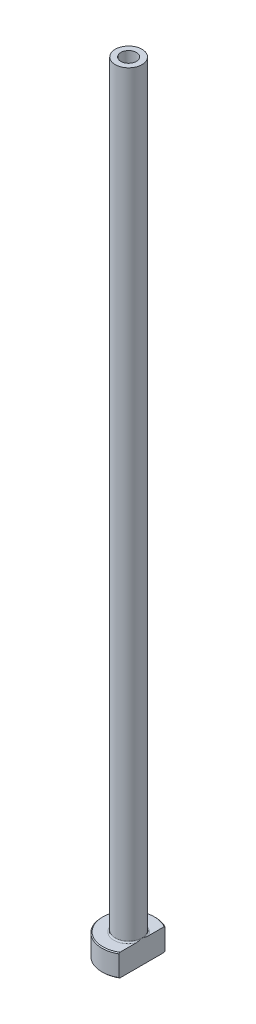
ISO-10303-21;
HEADER;
FILE_DESCRIPTION(('STEP AP214'),'2;1');
FILE_NAME('part.step','',(''),(''),'','','');
FILE_SCHEMA(('AUTOMOTIVE_DESIGN { 1 0 10303 214 1 1 1 1 }'));
ENDSEC;
DATA;
#1=APPLICATION_CONTEXT('core data for automotive mechanical design processes');
#2=APPLICATION_PROTOCOL_DEFINITION('international standard','automotive_design',2000,#1);
#3=PRODUCT_CONTEXT('',#1,'mechanical');
#4=PRODUCT('Part','Part','',(#3));
#5=PRODUCT_RELATED_PRODUCT_CATEGORY('part','',(#4));
#6=PRODUCT_DEFINITION_FORMATION('','',#4);
#7=PRODUCT_DEFINITION_CONTEXT('part definition',#1,'design');
#8=PRODUCT_DEFINITION('design','',#6,#7);
#9=PRODUCT_DEFINITION_SHAPE('','',#8);
#10=(LENGTH_UNIT() NAMED_UNIT(*) SI_UNIT(.MILLI.,.METRE.));
#11=(NAMED_UNIT(*) PLANE_ANGLE_UNIT() SI_UNIT($,.RADIAN.));
#12=(NAMED_UNIT(*) SI_UNIT($,.STERADIAN.) SOLID_ANGLE_UNIT());
#13=UNCERTAINTY_MEASURE_WITH_UNIT(LENGTH_MEASURE(1.E-05),#10,'distance_accuracy_value','');
#14=(GEOMETRIC_REPRESENTATION_CONTEXT(3) GLOBAL_UNCERTAINTY_ASSIGNED_CONTEXT((#13)) GLOBAL_UNIT_ASSIGNED_CONTEXT((#10,
#11,#12)) REPRESENTATION_CONTEXT('',''));
#15=CARTESIAN_POINT('',(0.,0.,0.));
#16=DIRECTION('',(0.,0.,1.));
#17=DIRECTION('',(1.,0.,0.));
#18=AXIS2_PLACEMENT_3D('',#15,#16,#17);
#19=CARTESIAN_POINT('',(0.,92.1876809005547,0.));
#20=DIRECTION('',(0.,1.,0.));
#21=DIRECTION('',(0.,0.,1.));
#22=AXIS2_PLACEMENT_3D('',#19,#20,#21);
#23=CYLINDRICAL_SURFACE('',#22,1.75);
#24=CARTESIAN_POINT('',(0.,175.,0.));
#25=DIRECTION('',(0.,1.,0.));
#26=DIRECTION('',(0.,0.,1.));
#27=AXIS2_PLACEMENT_3D('',#24,#25,#26);
#28=CIRCLE('',#27,1.75);
#29=CARTESIAN_POINT('',(0.,175.,1.75));
#30=VERTEX_POINT('',#29);
#31=EDGE_CURVE('E167',#30,#30,#28,.T.);
#32=ORIENTED_EDGE('',*,*,#31,.T.);
#33=EDGE_LOOP('',(#32));
#34=FACE_BOUND('',#33,.T.);
#35=CARTESIAN_POINT('',(0.,130.,0.));
#36=DIRECTION('',(0.,1.,0.));
#37=DIRECTION('',(0.,0.,1.));
#38=AXIS2_PLACEMENT_3D('',#35,#36,#37);
#39=CIRCLE('',#38,1.75);
#40=CARTESIAN_POINT('',(0.,130.,1.75));
#41=VERTEX_POINT('',#40);
#42=EDGE_CURVE('E170',#41,#41,#39,.T.);
#43=ORIENTED_EDGE('',*,*,#42,.F.);
#44=EDGE_LOOP('',(#43));
#45=FACE_BOUND('',#44,.T.);
#46=ADVANCED_FACE('F32',(#34,#45),#23,.F.);
#47=CARTESIAN_POINT('',(-1.75,175.,0.));
#48=DIRECTION('',(0.,1.,0.));
#49=DIRECTION('',(0.,0.,1.));
#50=AXIS2_PLACEMENT_3D('',#47,#48,#49);
#51=PLANE('',#50);
#52=CARTESIAN_POINT('',(0.,175.,0.));
#53=DIRECTION('',(0.,1.,0.));
#54=DIRECTION('',(0.,0.,1.));
#55=AXIS2_PLACEMENT_3D('',#52,#53,#54);
#56=CIRCLE('',#55,3.00000000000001);
#57=CARTESIAN_POINT('',(0.,175.,3.00000000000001));
#58=VERTEX_POINT('',#57);
#59=EDGE_CURVE('E174',#58,#58,#56,.T.);
#60=ORIENTED_EDGE('',*,*,#59,.T.);
#61=EDGE_LOOP('',(#60));
#62=FACE_BOUND('',#61,.T.);
#63=ORIENTED_EDGE('',*,*,#31,.F.);
#64=EDGE_LOOP('',(#63));
#65=FACE_BOUND('',#64,.T.);
#66=ADVANCED_FACE('F157',(#62,#65),#51,.T.);
#67=CARTESIAN_POINT('',(0.,92.1876809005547,0.));
#68=DIRECTION('',(0.,1.,0.));
#69=DIRECTION('',(0.,0.,1.));
#70=AXIS2_PLACEMENT_3D('',#67,#68,#69);
#71=CYLINDRICAL_SURFACE('',#70,3.);
#72=CARTESIAN_POINT('',(0.,5.3,0.));
#73=DIRECTION('',(0.,1.,0.));
#74=DIRECTION('',(0.,0.,1.));
#75=AXIS2_PLACEMENT_3D('',#72,#73,#74);
#76=CIRCLE('',#75,3.);
#77=CARTESIAN_POINT('',(3.,5.3,0.));
#78=VERTEX_POINT('',#77);
#79=EDGE_CURVE('E180',#78,#78,#76,.T.);
#80=ORIENTED_EDGE('',*,*,#79,.T.);
#81=EDGE_LOOP('',(#80));
#82=FACE_BOUND('',#81,.T.);
#83=ORIENTED_EDGE('',*,*,#59,.F.);
#84=EDGE_LOOP('',(#83));
#85=FACE_BOUND('',#84,.T.);
#86=ADVANCED_FACE('F162',(#82,#85),#71,.T.);
#87=CARTESIAN_POINT('',(-2.99999999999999,5.,0.));
#88=DIRECTION('',(0.,1.,0.));
#89=DIRECTION('',(0.,0.,1.));
#90=AXIS2_PLACEMENT_3D('',#87,#88,#89);
#91=PLANE('',#90);
#92=DIRECTION('',(0.,0.,1.));
#93=VECTOR('',#92,1.);
#94=CARTESIAN_POINT('',(3.,5.,0.));
#95=LINE('',#94,#93);
#96=CARTESIAN_POINT('',(3.,5.,-4.96386945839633));
#97=VERTEX_POINT('',#96);
#98=CARTESIAN_POINT('',(3.,5.,-1.37477270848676));
#99=VERTEX_POINT('',#98);
#100=EDGE_CURVE('E54',#97,#99,#95,.T.);
#101=ORIENTED_EDGE('',*,*,#100,.F.);
#102=CARTESIAN_POINT('',(0.,5.,0.));
#103=DIRECTION('',(0.,1.,0.));
#104=DIRECTION('',(0.,0.,1.));
#105=AXIS2_PLACEMENT_3D('',#102,#103,#104);
#106=CIRCLE('',#105,5.79999999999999);
#107=CARTESIAN_POINT('',(2.99999999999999,5.,4.96386945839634));
#108=VERTEX_POINT('',#107);
#109=EDGE_CURVE('E186',#97,#108,#106,.T.);
#110=ORIENTED_EDGE('',*,*,#109,.T.);
#111=CARTESIAN_POINT('',(3.,5.,1.37477270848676));
#112=VERTEX_POINT('',#111);
#113=EDGE_CURVE('E134',#112,#108,#95,.T.);
#114=ORIENTED_EDGE('',*,*,#113,.F.);
#115=CARTESIAN_POINT('',(0.,5.,0.));
#116=DIRECTION('',(0.,1.,0.));
#117=DIRECTION('',(0.,0.,1.));
#118=AXIS2_PLACEMENT_3D('',#115,#116,#117);
#119=CIRCLE('',#118,3.3);
#120=EDGE_CURVE('E183',#112,#99,#119,.F.);
#121=ORIENTED_EDGE('',*,*,#120,.T.);
#122=EDGE_LOOP('',(#101,#110,#114,#121));
#123=FACE_BOUND('',#122,.T.);
#124=ADVANCED_FACE('F197',(#123),#91,.T.);
#125=CARTESIAN_POINT('',(0.,92.1876809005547,0.));
#126=DIRECTION('',(0.,1.,0.));
#127=DIRECTION('',(0.,0.,1.));
#128=AXIS2_PLACEMENT_3D('',#125,#126,#127);
#129=CYLINDRICAL_SURFACE('',#128,5.99999999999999);
#130=DIRECTION('',(0.,-1.,0.));
#131=VECTOR('',#130,1.);
#132=CARTESIAN_POINT('',(2.99999999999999,175.,5.19615242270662));
#133=LINE('',#132,#131);
#134=CARTESIAN_POINT('',(2.99999999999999,4.8,5.19615242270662));
#135=VERTEX_POINT('',#134);
#136=CARTESIAN_POINT('',(2.99999999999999,0.20000000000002,5.19615242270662));
#137=VERTEX_POINT('',#136);
#138=EDGE_CURVE('E82',#135,#137,#133,.T.);
#139=ORIENTED_EDGE('',*,*,#138,.F.);
#140=CARTESIAN_POINT('',(0.,4.8,0.));
#141=DIRECTION('',(0.,1.,0.));
#142=DIRECTION('',(0.,0.,1.));
#143=AXIS2_PLACEMENT_3D('',#140,#141,#142);
#144=CIRCLE('',#143,5.99999999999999);
#145=CARTESIAN_POINT('',(3.,4.8,-5.19615242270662));
#146=VERTEX_POINT('',#145);
#147=EDGE_CURVE('E95',#135,#146,#144,.F.);
#148=ORIENTED_EDGE('',*,*,#147,.T.);
#149=DIRECTION('',(0.,-1.,0.));
#150=VECTOR('',#149,1.);
#151=CARTESIAN_POINT('',(3.,175.,-5.19615242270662));
#152=LINE('',#151,#150);
#153=CARTESIAN_POINT('',(3.,0.20000000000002,-5.19615242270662));
#154=VERTEX_POINT('',#153);
#155=EDGE_CURVE('E192',#146,#154,#152,.T.);
#156=ORIENTED_EDGE('',*,*,#155,.T.);
#157=CARTESIAN_POINT('',(0.,0.20000000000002,0.));
#158=DIRECTION('',(0.,-1.,0.));
#159=DIRECTION('',(0.,0.,-1.));
#160=AXIS2_PLACEMENT_3D('',#157,#158,#159);
#161=CIRCLE('',#160,5.99999999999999);
#162=EDGE_CURVE('E98',#154,#137,#161,.F.);
#163=ORIENTED_EDGE('',*,*,#162,.T.);
#164=EDGE_LOOP('',(#139,#148,#156,#163));
#165=FACE_BOUND('',#164,.T.);
#166=ADVANCED_FACE('F190',(#165),#129,.T.);
#167=CARTESIAN_POINT('',(-5.99999999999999,0.,0.));
#168=DIRECTION('',(0.,-1.,0.));
#169=DIRECTION('',(0.,0.,-1.));
#170=AXIS2_PLACEMENT_3D('',#167,#168,#169);
#171=PLANE('',#170);
#172=CARTESIAN_POINT('',(0.,0.,0.));
#173=DIRECTION('',(0.,-1.,0.));
#174=DIRECTION('',(0.,0.,-1.));
#175=AXIS2_PLACEMENT_3D('',#172,#173,#174);
#176=CIRCLE('',#175,2.49999999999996);
#177=CARTESIAN_POINT('',(0.,0.,-2.49999999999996));
#178=VERTEX_POINT('',#177);
#179=EDGE_CURVE('E40',#178,#178,#176,.F.);
#180=ORIENTED_EDGE('',*,*,#179,.T.);
#181=EDGE_LOOP('',(#180));
#182=FACE_BOUND('',#181,.T.);
#183=DIRECTION('',(0.,0.,-1.));
#184=VECTOR('',#183,1.);
#185=CARTESIAN_POINT('',(2.99999999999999,0.,5.19615242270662));
#186=LINE('',#185,#184);
#187=CARTESIAN_POINT('',(2.99999999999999,0.,4.96386945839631));
#188=VERTEX_POINT('',#187);
#189=CARTESIAN_POINT('',(2.99999999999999,0.,-4.96386945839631));
#190=VERTEX_POINT('',#189);
#191=EDGE_CURVE('E47',#188,#190,#186,.T.);
#192=ORIENTED_EDGE('',*,*,#191,.F.);
#193=CARTESIAN_POINT('',(0.,0.,0.));
#194=DIRECTION('',(0.,-1.,0.));
#195=DIRECTION('',(0.,0.,-1.));
#196=AXIS2_PLACEMENT_3D('',#193,#194,#195);
#197=CIRCLE('',#196,5.79999999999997);
#198=EDGE_CURVE('E92',#188,#190,#197,.T.);
#199=ORIENTED_EDGE('',*,*,#198,.T.);
#200=EDGE_LOOP('',(#192,#199));
#201=FACE_BOUND('',#200,.T.);
#202=ADVANCED_FACE('F91',(#182,#201),#171,.T.);
#203=CARTESIAN_POINT('',(0.,92.1876809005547,0.));
#204=DIRECTION('',(0.,1.,0.));
#205=DIRECTION('',(0.,0.,1.));
#206=AXIS2_PLACEMENT_3D('',#203,#204,#205);
#207=CYLINDRICAL_SURFACE('',#206,2.);
#208=CARTESIAN_POINT('',(0.,0.499999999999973,0.));
#209=DIRECTION('',(0.,-1.,0.));
#210=DIRECTION('',(0.,0.,-1.));
#211=AXIS2_PLACEMENT_3D('',#208,#209,#210);
#212=CIRCLE('',#211,2.);
#213=CARTESIAN_POINT('',(0.,0.499999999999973,-2.));
#214=VERTEX_POINT('',#213);
#215=EDGE_CURVE('E11',#214,#214,#212,.T.);
#216=ORIENTED_EDGE('',*,*,#215,.T.);
#217=EDGE_LOOP('',(#216));
#218=FACE_BOUND('',#217,.T.);
#219=CARTESIAN_POINT('',(0.,118.,0.));
#220=DIRECTION('',(0.,1.,0.));
#221=DIRECTION('',(0.,0.,1.));
#222=AXIS2_PLACEMENT_3D('',#219,#220,#221);
#223=CIRCLE('',#222,2.);
#224=CARTESIAN_POINT('',(0.,118.,2.));
#225=VERTEX_POINT('',#224);
#226=EDGE_CURVE('E172',#225,#225,#223,.T.);
#227=ORIENTED_EDGE('',*,*,#226,.T.);
#228=EDGE_LOOP('',(#227));
#229=FACE_BOUND('',#228,.T.);
#230=ADVANCED_FACE('F215',(#218,#229),#207,.F.);
#231=CARTESIAN_POINT('',(0.,118.,0.));
#232=DIRECTION('',(0.,-1.,0.));
#233=DIRECTION('',(0.,0.,-1.));
#234=AXIS2_PLACEMENT_3D('',#231,#232,#233);
#235=CONICAL_SURFACE('',#234,2.,0.0208303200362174);
#236=ORIENTED_EDGE('',*,*,#42,.T.);
#237=EDGE_LOOP('',(#236));
#238=FACE_BOUND('',#237,.T.);
#239=ORIENTED_EDGE('',*,*,#226,.F.);
#240=EDGE_LOOP('',(#239));
#241=FACE_BOUND('',#240,.T.);
#242=ADVANCED_FACE('F111',(#238,#241),#235,.F.);
#243=CARTESIAN_POINT('',(0.,5.3,0.));
#244=DIRECTION('',(0.,1.,0.));
#245=DIRECTION('',(0.,0.,1.));
#246=AXIS2_PLACEMENT_3D('',#243,#244,#245);
#247=TOROIDAL_SURFACE('',#246,3.3,0.3);
#248=ORIENTED_EDGE('',*,*,#120,.F.);
#249=CARTESIAN_POINT('',(3.,5.3,0.));
#250=CARTESIAN_POINT('',(3.,5.30000062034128,-1.12611973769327E-10));
#251=CARTESIAN_POINT('',(3.,5.30000124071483,1.79706824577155E-07));
#252=CARTESIAN_POINT('',(3.,5.30000241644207,7.12597590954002E-07));
#253=CARTESIAN_POINT('',(3.,5.30000296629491,1.07470913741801E-06));
#254=CARTESIAN_POINT('',(3.,5.30000408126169,1.93940830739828E-06));
#255=CARTESIAN_POINT('',(3.,5.30000463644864,2.45488622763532E-06));
#256=CARTESIAN_POINT('',(3.,5.30000565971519,3.54465557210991E-06));
#257=CARTESIAN_POINT('',(3.,5.30000612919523,4.11770701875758E-06));
#258=CARTESIAN_POINT('',(3.,5.30000778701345,6.25396492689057E-06));
#259=CARTESIAN_POINT('',(3.,5.30000888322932,7.89070903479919E-06));
#260=CARTESIAN_POINT('',(3.,5.30001076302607,1.1199805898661E-05));
#261=CARTESIAN_POINT('',(3.,5.30001156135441,1.28642117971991E-05));
#262=CARTESIAN_POINT('',(3.,5.30001474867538,1.96537181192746E-05));
#263=CARTESIAN_POINT('',(3.,5.30001702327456,2.48380251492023E-05));
#264=CARTESIAN_POINT('',(3.,5.30002052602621,3.48178497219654E-05));
#265=CARTESIAN_POINT('',(3.,5.30002184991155,3.95800639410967E-05));
#266=CARTESIAN_POINT('',(2.99999999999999,5.30003122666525,7.41814399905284E-05));
#267=CARTESIAN_POINT('',(2.99999999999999,5.30003808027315,0.000104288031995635));
#268=CARTESIAN_POINT('',(3.,5.30006804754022,0.000222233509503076));
#269=CARTESIAN_POINT('',(2.99999999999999,5.3000968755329,0.00030855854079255));
#270=CARTESIAN_POINT('',(2.99999999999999,5.30020809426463,0.000648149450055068));
#271=CARTESIAN_POINT('',(2.99999999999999,5.30028657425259,0.00090233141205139));
#272=CARTESIAN_POINT('',(3.,5.30059876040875,0.00190491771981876));
#273=CARTESIAN_POINT('',(2.99999999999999,5.3008372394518,0.00265218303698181));
#274=CARTESIAN_POINT('',(2.99999999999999,5.30182192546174,0.00574694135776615));
#275=CARTESIAN_POINT('',(2.99999999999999,5.30256224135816,0.00809584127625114));
#276=CARTESIAN_POINT('',(3.,5.31160267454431,0.0367678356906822));
#277=CARTESIAN_POINT('',(3.,5.3199381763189,0.0630827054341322));
#278=CARTESIAN_POINT('',(2.99999999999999,5.33621504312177,0.114704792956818));
#279=CARTESIAN_POINT('',(2.99999999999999,5.34415908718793,0.140011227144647));
#280=CARTESIAN_POINT('',(3.,5.36094382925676,0.193774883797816));
#281=CARTESIAN_POINT('',(2.99999999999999,5.36977415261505,0.222235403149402));
#282=CARTESIAN_POINT('',(2.99999999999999,5.3873647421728,0.279512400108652));
#283=CARTESIAN_POINT('',(2.99999999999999,5.3961232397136,0.308329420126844));
#284=CARTESIAN_POINT('',(2.99999999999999,5.41726575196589,0.378880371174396));
#285=CARTESIAN_POINT('',(2.99999999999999,5.42952723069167,0.420651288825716));
#286=CARTESIAN_POINT('',(2.99999999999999,5.45309597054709,0.503357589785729));
#287=CARTESIAN_POINT('',(2.99999999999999,5.46441924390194,0.544288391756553));
#288=CARTESIAN_POINT('',(2.99999999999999,5.48778169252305,0.632156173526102));
#289=CARTESIAN_POINT('',(2.99999999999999,5.49969678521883,0.679126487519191));
#290=CARTESIAN_POINT('',(2.99999999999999,5.52221484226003,0.773740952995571));
#291=CARTESIAN_POINT('',(2.99999999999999,5.53280772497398,0.821387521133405));
#292=CARTESIAN_POINT('',(2.99999999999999,5.55291503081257,0.920589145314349));
#293=CARTESIAN_POINT('',(2.99999999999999,5.56229188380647,0.972172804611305));
#294=CARTESIAN_POINT('',(2.99999999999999,5.57838694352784,1.0757483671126));
#295=CARTESIAN_POINT('',(2.99999999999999,5.58510535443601,1.12774023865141));
#296=CARTESIAN_POINT('',(2.99999999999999,5.59681427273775,1.2492441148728));
#297=CARTESIAN_POINT('',(2.99999999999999,5.60051317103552,1.3189036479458));
#298=CARTESIAN_POINT('',(2.99999999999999,5.59966579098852,1.42270835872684));
#299=CARTESIAN_POINT('',(2.99999999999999,5.59835823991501,1.45688093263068));
#300=CARTESIAN_POINT('',(2.99999999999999,5.59322745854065,1.52502533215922));
#301=CARTESIAN_POINT('',(2.99999999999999,5.58940645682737,1.55899730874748));
#302=CARTESIAN_POINT('',(2.99999999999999,5.57976146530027,1.61947815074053));
#303=CARTESIAN_POINT('',(2.99999999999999,5.57451506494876,1.64607760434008));
#304=CARTESIAN_POINT('',(2.99999999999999,5.56161153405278,1.69883648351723));
#305=CARTESIAN_POINT('',(2.99999999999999,5.55394338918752,1.72499331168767));
#306=CARTESIAN_POINT('',(2.99999999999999,5.53555176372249,1.77650913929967));
#307=CARTESIAN_POINT('',(2.99999999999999,5.52480031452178,1.80185836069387));
#308=CARTESIAN_POINT('',(2.99999999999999,5.49948027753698,1.8505454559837));
#309=CARTESIAN_POINT('',(2.99999999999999,5.48493141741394,1.87389291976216));
#310=CARTESIAN_POINT('',(2.99999999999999,5.45992470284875,1.90552135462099));
#311=CARTESIAN_POINT('',(2.99999999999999,5.45133318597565,1.91527363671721));
#312=CARTESIAN_POINT('',(2.99999999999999,5.43294163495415,1.93360072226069));
#313=CARTESIAN_POINT('',(2.99999999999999,5.42314083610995,1.94217477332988));
#314=CARTESIAN_POINT('',(2.99999999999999,5.40215892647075,1.95778354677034));
#315=CARTESIAN_POINT('',(2.99999999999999,5.39096156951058,1.96479687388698));
#316=CARTESIAN_POINT('',(2.99999999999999,5.36742144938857,1.97652218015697));
#317=CARTESIAN_POINT('',(2.99999999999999,5.35508207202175,1.98124071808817));
#318=CARTESIAN_POINT('',(2.99999999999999,5.33320117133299,1.98690185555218));
#319=CARTESIAN_POINT('',(2.99999999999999,5.32383559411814,1.98852953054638));
#320=CARTESIAN_POINT('',(2.99999999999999,5.30496375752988,1.99016898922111));
#321=CARTESIAN_POINT('',(2.99999999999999,5.29545756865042,1.9901815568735));
#322=CARTESIAN_POINT('',(2.99999999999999,5.27659318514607,1.98858978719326));
#323=CARTESIAN_POINT('',(2.99999999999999,5.26723486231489,1.98698693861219));
#324=CARTESIAN_POINT('',(2.99999999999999,5.24889957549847,1.98229727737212));
#325=CARTESIAN_POINT('',(2.99999999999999,5.23992286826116,1.97920948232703));
#326=CARTESIAN_POINT('',(2.99999999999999,5.21981293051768,1.97059641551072));
#327=CARTESIAN_POINT('',(2.99999999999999,5.20887713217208,1.9646117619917));
#328=CARTESIAN_POINT('',(2.99999999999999,5.18811536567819,1.95095727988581));
#329=CARTESIAN_POINT('',(2.99999999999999,5.17829177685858,1.94328393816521));
#330=CARTESIAN_POINT('',(2.99999999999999,5.15512177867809,1.922542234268));
#331=CARTESIAN_POINT('',(2.99999999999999,5.14247568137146,1.90869680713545));
#332=CARTESIAN_POINT('',(2.99999999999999,5.11944595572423,1.87927587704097));
#333=CARTESIAN_POINT('',(2.99999999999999,5.10906527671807,1.86369815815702));
#334=CARTESIAN_POINT('',(2.99999999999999,5.08309609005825,1.81927355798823));
#335=CARTESIAN_POINT('',(2.99999999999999,5.0694854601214,1.78928084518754));
#336=CARTESIAN_POINT('',(2.99999999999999,5.04658664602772,1.7275196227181));
#337=CARTESIAN_POINT('',(2.99999999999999,5.03733582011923,1.69573828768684));
#338=CARTESIAN_POINT('',(2.99999999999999,5.02214318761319,1.63079918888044));
#339=CARTESIAN_POINT('',(2.99999999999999,5.01626537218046,1.59762686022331));
#340=CARTESIAN_POINT('',(2.99999999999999,5.00734002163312,1.53086029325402));
#341=CARTESIAN_POINT('',(2.99999999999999,5.0042979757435,1.49726536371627));
#342=CARTESIAN_POINT('',(2.99999999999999,5.00059037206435,1.43100872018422));
#343=CARTESIAN_POINT('',(2.99999999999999,4.99985343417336,1.39835069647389));
#344=CARTESIAN_POINT('',(2.99999999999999,5.000193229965,1.33318312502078));
#345=CARTESIAN_POINT('',(2.99999999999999,5.00126261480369,1.30067351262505));
#346=CARTESIAN_POINT('',(2.99999999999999,5.00569854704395,1.22190465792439));
#347=CARTESIAN_POINT('',(2.99999999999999,5.00984986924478,1.17569031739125));
#348=CARTESIAN_POINT('',(2.99999999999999,5.0206087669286,1.0835706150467));
#349=CARTESIAN_POINT('',(2.99999999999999,5.0272158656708,1.03766519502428));
#350=CARTESIAN_POINT('',(2.99999999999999,5.04258096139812,0.945130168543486));
#351=CARTESIAN_POINT('',(2.99999999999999,5.0513851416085,0.898508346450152));
#352=CARTESIAN_POINT('',(2.99999999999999,5.07066869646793,0.805496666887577));
#353=CARTESIAN_POINT('',(2.99999999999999,5.08115218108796,0.759107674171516));
#354=CARTESIAN_POINT('',(2.99999999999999,5.10738921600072,0.650207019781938));
#355=CARTESIAN_POINT('',(2.99999999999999,5.12369110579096,0.587828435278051));
#356=CARTESIAN_POINT('',(2.99999999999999,5.15777680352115,0.464212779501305));
#357=CARTESIAN_POINT('',(2.99999999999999,5.17554263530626,0.402970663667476));
#358=CARTESIAN_POINT('',(2.99999999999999,5.21006724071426,0.28759690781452));
#359=CARTESIAN_POINT('',(3.,5.22671796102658,0.233432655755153));
#360=CARTESIAN_POINT('',(2.99999999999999,5.25241226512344,0.150940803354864));
#361=CARTESIAN_POINT('',(2.99999999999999,5.26131063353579,0.122567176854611));
#362=CARTESIAN_POINT('',(3.,5.27905176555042,0.0662804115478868));
#363=CARTESIAN_POINT('',(3.,5.28789327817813,0.038366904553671));
#364=CARTESIAN_POINT('',(2.99999999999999,5.29743877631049,0.00809257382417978));
#365=CARTESIAN_POINT('',(2.99999999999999,5.29818012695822,0.00574041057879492));
#366=CARTESIAN_POINT('',(2.99999999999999,5.29916506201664,0.0026448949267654));
#367=CARTESIAN_POINT('',(3.,5.29940274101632,0.00190013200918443));
#368=CARTESIAN_POINT('',(2.99999999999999,5.29971394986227,0.000900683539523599));
#369=CARTESIAN_POINT('',(2.99999999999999,5.29979223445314,0.000647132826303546));
#370=CARTESIAN_POINT('',(2.99999999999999,5.29990321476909,0.000308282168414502));
#371=CARTESIAN_POINT('',(3.,5.29993200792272,0.00022206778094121));
#372=CARTESIAN_POINT('',(2.99999999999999,5.29996194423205,0.000104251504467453));
#373=CARTESIAN_POINT('',(2.99999999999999,5.29996879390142,7.41614237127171E-05));
#374=CARTESIAN_POINT('',(3.,5.29997816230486,3.9576670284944E-05));
#375=CARTESIAN_POINT('',(3.,5.29997948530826,3.48154662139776E-05));
#376=CARTESIAN_POINT('',(3.,5.29998298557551,2.48376276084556E-05));
#377=CARTESIAN_POINT('',(3.,5.29998525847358,1.96542450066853E-05));
#378=CARTESIAN_POINT('',(3.,5.29998844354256,1.28656652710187E-05));
#379=CARTESIAN_POINT('',(3.,5.29998924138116,1.12013347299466E-05));
#380=CARTESIAN_POINT('',(3.,5.29999112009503,7.89230008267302E-06));
#381=CARTESIAN_POINT('',(3.,5.29999221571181,6.25553517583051E-06));
#382=CARTESIAN_POINT('',(3.,5.29999387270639,4.11914356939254E-06));
#383=CARTESIAN_POINT('',(3.,5.29999434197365,3.54603083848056E-06));
#384=CARTESIAN_POINT('',(3.,5.29999536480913,2.45610059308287E-06));
#385=CARTESIAN_POINT('',(3.,5.29999591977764,1.94052220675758E-06));
#386=CARTESIAN_POINT('',(3.,5.2999970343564,1.07558317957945E-06));
#387=CARTESIAN_POINT('',(3.,5.29999758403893,7.13339401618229E-07));
#388=CARTESIAN_POINT('',(3.,5.29999875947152,1.80121922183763E-07));
#389=CARTESIAN_POINT('',(3.,5.29999937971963,1.12601418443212E-10));
#390=CARTESIAN_POINT('',(3.,5.3,0.));
#391=B_SPLINE_CURVE_WITH_KNOTS('',3,(#249,#250,#251,#252,#253,#254,#255,#256,#257,#258,#259,
#260,#261,#262,#263,#264,#265,#266,#267,#268,#269,#270,#271,#272,#273,#274,#275,#276,#277,#278,
#279,#280,#281,#282,#283,#284,#285,#286,#287,#288,#289,#290,#291,#292,#293,#294,#295,#296,#297,
#298,#299,#300,#301,#302,#303,#304,#305,#306,#307,#308,#309,#310,#311,#312,#313,#314,#315,#316,
#317,#318,#319,#320,#321,#322,#323,#324,#325,#326,#327,#328,#329,#330,#331,#332,#333,#334,#335,
#336,#337,#338,#339,#340,#341,#342,#343,#344,#345,#346,#347,#348,#349,#350,#351,#352,#353,#354,
#355,#356,#357,#358,#359,#360,#361,#362,#363,#364,#365,#366,#367,#368,#369,#370,#371,#372,#373,
#374,#375,#376,#377,#378,#379,#380,#381,#382,#383,#384,#385,#386,#387,#388,#389,#390),
.UNSPECIFIED.,.T.,.F.,(4,2,2,2,2,2,2,2,2,2,2,2,2,2,2,2,2,2,2,2,2,2,2,2,2,2,2,2,2,2,2,2,2,2,2,2,
2,2,2,2,2,2,2,2,2,2,2,2,2,2,2,2,2,2,2,2,2,2,2,2,2,2,2,2,2,2,2,2,2,2,4),(0.,1.86513864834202E-06,
3.83353246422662E-06,6.09513236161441E-06,8.31560540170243E-06,1.42000698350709E-05,
1.97335497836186E-05,3.66769861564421E-05,5.14858313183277E-05,0.000144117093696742,
0.00041677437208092,0.00121521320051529,0.00356794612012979,0.0109568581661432,
0.0937636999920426,0.173336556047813,0.262732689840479,0.353088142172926,0.483684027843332,
0.611082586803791,0.756439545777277,0.902844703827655,1.06007042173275,1.21728406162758,
1.4261166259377,1.52864191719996,1.63107642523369,1.71232857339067,1.79395571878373,
1.87634808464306,1.95832065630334,1.99722769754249,2.03615946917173,2.07559591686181,
2.11491897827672,2.14330913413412,2.1716855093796,2.20003575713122,2.22840478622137,
2.26559554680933,2.30286442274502,2.35880214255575,2.41481225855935,2.51307007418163,
2.61215518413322,2.71306273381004,2.81416520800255,2.91210427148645,3.00964583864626,
3.14875779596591,3.28784276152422,3.43014232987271,3.5727956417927,3.76617940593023,
3.95746724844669,4.12746077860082,4.21667041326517,4.30450746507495,4.31190664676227,
4.31425150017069,4.31504795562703,4.31532026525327,4.31541284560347,4.31542765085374,
4.31544458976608,4.31545012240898,4.31545600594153,4.315458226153,4.31546048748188,
4.31546245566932,4.31546432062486),.UNSPECIFIED.);
#392=EDGE_CURVE('E126',#112,#78,#391,.T.);
#393=ORIENTED_EDGE('',*,*,#392,.T.);
#394=ORIENTED_EDGE('',*,*,#79,.F.);
#395=CARTESIAN_POINT('',(3.,5.3,0.));
#396=CARTESIAN_POINT('',(3.,5.29999937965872,1.12612604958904E-10));
#397=CARTESIAN_POINT('',(3.,5.29999875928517,-1.79706824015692E-07));
#398=CARTESIAN_POINT('',(3.,5.29999758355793,-7.12597590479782E-07));
#399=CARTESIAN_POINT('',(3.,5.29999703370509,-1.07470913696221E-06));
#400=CARTESIAN_POINT('',(3.,5.29999591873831,-1.93940830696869E-06));
#401=CARTESIAN_POINT('',(3.,5.29999536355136,-2.45488622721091E-06));
#402=CARTESIAN_POINT('',(3.,5.29999434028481,-3.54465557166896E-06));
#403=CARTESIAN_POINT('',(3.,5.29999387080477,-4.1177070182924E-06));
#404=CARTESIAN_POINT('',(3.,5.29999221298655,-6.25396492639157E-06));
#405=CARTESIAN_POINT('',(3.,5.29999111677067,-7.89070903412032E-06));
#406=CARTESIAN_POINT('',(3.,5.29998923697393,-1.11998058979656E-05));
#407=CARTESIAN_POINT('',(3.,5.29998843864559,-1.28642117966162E-05));
#408=CARTESIAN_POINT('',(3.,5.29998525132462,-1.96537181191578E-05));
#409=CARTESIAN_POINT('',(3.,5.29998297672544,-2.48380251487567E-05));
#410=CARTESIAN_POINT('',(3.,5.29997947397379,-3.48178497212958E-05));
#411=CARTESIAN_POINT('',(3.,5.29997815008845,-3.95800639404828E-05));
#412=CARTESIAN_POINT('',(2.99999999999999,5.29996877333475,-7.41814399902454E-05));
#413=CARTESIAN_POINT('',(2.99999999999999,5.29996191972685,-0.000104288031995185));
#414=CARTESIAN_POINT('',(3.,5.29993195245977,-0.000222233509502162));
#415=CARTESIAN_POINT('',(2.99999999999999,5.2999031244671,-0.000308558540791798));
#416=CARTESIAN_POINT('',(2.99999999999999,5.29979190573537,-0.000648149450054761));
#417=CARTESIAN_POINT('',(2.99999999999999,5.2997134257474,-0.00090233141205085));
#418=CARTESIAN_POINT('',(3.,5.29940123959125,-0.00190491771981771));
#419=CARTESIAN_POINT('',(2.99999999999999,5.29916276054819,-0.00265218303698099));
#420=CARTESIAN_POINT('',(2.99999999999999,5.29817807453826,-0.00574694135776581));
#421=CARTESIAN_POINT('',(2.99999999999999,5.29743775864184,-0.00809584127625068));
#422=CARTESIAN_POINT('',(3.,5.28839732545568,-0.0367678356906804));
#423=CARTESIAN_POINT('',(3.,5.2800618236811,-0.0630827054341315));
#424=CARTESIAN_POINT('',(2.99999999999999,5.26378495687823,-0.114704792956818));
#425=CARTESIAN_POINT('',(2.99999999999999,5.25584091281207,-0.140011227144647));
#426=CARTESIAN_POINT('',(3.,5.23905617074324,-0.193774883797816));
#427=CARTESIAN_POINT('',(2.99999999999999,5.23022584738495,-0.222235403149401));
#428=CARTESIAN_POINT('',(2.99999999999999,5.2126352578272,-0.279512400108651));
#429=CARTESIAN_POINT('',(2.99999999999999,5.2038767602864,-0.308329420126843));
#430=CARTESIAN_POINT('',(2.99999999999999,5.18273424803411,-0.378880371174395));
#431=CARTESIAN_POINT('',(2.99999999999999,5.17047276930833,-0.420651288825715));
#432=CARTESIAN_POINT('',(2.99999999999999,5.14690402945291,-0.503357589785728));
#433=CARTESIAN_POINT('',(2.99999999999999,5.13558075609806,-0.544288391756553));
#434=CARTESIAN_POINT('',(2.99999999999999,5.11221830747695,-0.632156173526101));
#435=CARTESIAN_POINT('',(2.99999999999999,5.10030321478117,-0.67912648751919));
#436=CARTESIAN_POINT('',(2.99999999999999,5.07778515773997,-0.773740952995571));
#437=CARTESIAN_POINT('',(2.99999999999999,5.06719227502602,-0.821387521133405));
#438=CARTESIAN_POINT('',(2.99999999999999,5.04708496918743,-0.920589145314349));
#439=CARTESIAN_POINT('',(2.99999999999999,5.03770811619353,-0.972172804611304));
#440=CARTESIAN_POINT('',(2.99999999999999,5.02161305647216,-1.07574836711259));
#441=CARTESIAN_POINT('',(2.99999999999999,5.01489464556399,-1.12774023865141));
#442=CARTESIAN_POINT('',(2.99999999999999,5.00318572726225,-1.2492441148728));
#443=CARTESIAN_POINT('',(2.99999999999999,4.99948682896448,-1.3189036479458));
#444=CARTESIAN_POINT('',(2.99999999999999,5.00033420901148,-1.42270835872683));
#445=CARTESIAN_POINT('',(2.99999999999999,5.00164176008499,-1.45688093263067));
#446=CARTESIAN_POINT('',(2.99999999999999,5.00677254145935,-1.52502533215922));
#447=CARTESIAN_POINT('',(2.99999999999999,5.01059354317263,-1.55899730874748));
#448=CARTESIAN_POINT('',(2.99999999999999,5.02023853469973,-1.61947815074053));
#449=CARTESIAN_POINT('',(2.99999999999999,5.02548493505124,-1.64607760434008));
#450=CARTESIAN_POINT('',(2.99999999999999,5.03838846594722,-1.69883648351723));
#451=CARTESIAN_POINT('',(2.99999999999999,5.04605661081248,-1.72499331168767));
#452=CARTESIAN_POINT('',(2.99999999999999,5.06444823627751,-1.77650913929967));
#453=CARTESIAN_POINT('',(2.99999999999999,5.07519968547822,-1.80185836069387));
#454=CARTESIAN_POINT('',(2.99999999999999,5.10051972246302,-1.8505454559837));
#455=CARTESIAN_POINT('',(2.99999999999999,5.11506858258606,-1.87389291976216));
#456=CARTESIAN_POINT('',(2.99999999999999,5.14007529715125,-1.905521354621));
#457=CARTESIAN_POINT('',(2.99999999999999,5.14866681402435,-1.91527363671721));
#458=CARTESIAN_POINT('',(2.99999999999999,5.16705836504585,-1.9336007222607));
#459=CARTESIAN_POINT('',(2.99999999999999,5.17685916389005,-1.94217477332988));
#460=CARTESIAN_POINT('',(2.99999999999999,5.19784107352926,-1.95778354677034));
#461=CARTESIAN_POINT('',(2.99999999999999,5.20903843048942,-1.96479687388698));
#462=CARTESIAN_POINT('',(2.99999999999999,5.23257855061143,-1.97652218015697));
#463=CARTESIAN_POINT('',(2.99999999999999,5.24491792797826,-1.98124071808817));
#464=CARTESIAN_POINT('',(2.99999999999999,5.26679882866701,-1.98690185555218));
#465=CARTESIAN_POINT('',(2.99999999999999,5.27616440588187,-1.98852953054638));
#466=CARTESIAN_POINT('',(2.99999999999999,5.29503624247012,-1.99016898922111));
#467=CARTESIAN_POINT('',(2.99999999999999,5.30454243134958,-1.9901815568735));
#468=CARTESIAN_POINT('',(2.99999999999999,5.32340681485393,-1.98858978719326));
#469=CARTESIAN_POINT('',(2.99999999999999,5.33276513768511,-1.98698693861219));
#470=CARTESIAN_POINT('',(2.99999999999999,5.35110042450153,-1.98229727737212));
#471=CARTESIAN_POINT('',(2.99999999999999,5.36007713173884,-1.97920948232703));
#472=CARTESIAN_POINT('',(2.99999999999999,5.38018706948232,-1.97059641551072));
#473=CARTESIAN_POINT('',(2.99999999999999,5.39112286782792,-1.9646117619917));
#474=CARTESIAN_POINT('',(2.99999999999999,5.41188463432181,-1.9509572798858));
#475=CARTESIAN_POINT('',(2.99999999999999,5.42170822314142,-1.94328393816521));
#476=CARTESIAN_POINT('',(2.99999999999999,5.44487822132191,-1.92254223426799));
#477=CARTESIAN_POINT('',(2.99999999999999,5.45752431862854,-1.90869680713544));
#478=CARTESIAN_POINT('',(2.99999999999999,5.48055404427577,-1.87927587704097));
#479=CARTESIAN_POINT('',(2.99999999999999,5.49093472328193,-1.86369815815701));
#480=CARTESIAN_POINT('',(2.99999999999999,5.51690390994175,-1.81927355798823));
#481=CARTESIAN_POINT('',(2.99999999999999,5.5305145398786,-1.78928084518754));
#482=CARTESIAN_POINT('',(2.99999999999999,5.55341335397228,-1.7275196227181));
#483=CARTESIAN_POINT('',(2.99999999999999,5.56266417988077,-1.69573828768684));
#484=CARTESIAN_POINT('',(2.99999999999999,5.57785681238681,-1.63079918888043));
#485=CARTESIAN_POINT('',(2.99999999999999,5.58373462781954,-1.59762686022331));
#486=CARTESIAN_POINT('',(2.99999999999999,5.59265997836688,-1.53086029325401));
#487=CARTESIAN_POINT('',(2.99999999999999,5.5957020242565,-1.49726536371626));
#488=CARTESIAN_POINT('',(2.99999999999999,5.59940962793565,-1.43100872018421));
#489=CARTESIAN_POINT('',(2.99999999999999,5.60014656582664,-1.39835069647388));
#490=CARTESIAN_POINT('',(2.99999999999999,5.59980677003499,-1.33318312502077));
#491=CARTESIAN_POINT('',(2.99999999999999,5.59873738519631,-1.30067351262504));
#492=CARTESIAN_POINT('',(2.99999999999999,5.59430145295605,-1.22190465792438));
#493=CARTESIAN_POINT('',(2.99999999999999,5.59015013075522,-1.17569031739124));
#494=CARTESIAN_POINT('',(2.99999999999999,5.5793912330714,-1.08357061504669));
#495=CARTESIAN_POINT('',(2.99999999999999,5.57278413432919,-1.03766519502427));
#496=CARTESIAN_POINT('',(2.99999999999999,5.55741903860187,-0.945130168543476));
#497=CARTESIAN_POINT('',(2.99999999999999,5.54861485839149,-0.898508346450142));
#498=CARTESIAN_POINT('',(2.99999999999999,5.52933130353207,-0.805496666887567));
#499=CARTESIAN_POINT('',(2.99999999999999,5.51884781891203,-0.759107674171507));
#500=CARTESIAN_POINT('',(2.99999999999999,5.49261078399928,-0.650207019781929));
#501=CARTESIAN_POINT('',(2.99999999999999,5.47630889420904,-0.587828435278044));
#502=CARTESIAN_POINT('',(2.99999999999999,5.44222319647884,-0.4642127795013));
#503=CARTESIAN_POINT('',(2.99999999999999,5.42445736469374,-0.402970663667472));
#504=CARTESIAN_POINT('',(2.99999999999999,5.38993275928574,-0.287596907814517));
#505=CARTESIAN_POINT('',(3.,5.37328203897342,-0.23343265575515));
#506=CARTESIAN_POINT('',(2.99999999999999,5.34758773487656,-0.150940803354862));
#507=CARTESIAN_POINT('',(2.99999999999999,5.33868936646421,-0.122567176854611));
#508=CARTESIAN_POINT('',(3.,5.32094823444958,-0.0662804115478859));
#509=CARTESIAN_POINT('',(3.,5.31210672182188,-0.0383669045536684));
#510=CARTESIAN_POINT('',(2.99999999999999,5.3025612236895,-0.0080925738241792));
#511=CARTESIAN_POINT('',(2.99999999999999,5.30181987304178,-0.00574041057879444));
#512=CARTESIAN_POINT('',(2.99999999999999,5.30083493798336,-0.00264489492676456));
#513=CARTESIAN_POINT('',(3.,5.30059725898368,-0.00190013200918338));
#514=CARTESIAN_POINT('',(2.99999999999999,5.30028605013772,-0.000900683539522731));
#515=CARTESIAN_POINT('',(2.99999999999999,5.30020776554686,-0.000647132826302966));
#516=CARTESIAN_POINT('',(2.99999999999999,5.30009678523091,-0.000308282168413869));
#517=CARTESIAN_POINT('',(3.,5.30006799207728,-0.000222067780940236));
#518=CARTESIAN_POINT('',(2.99999999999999,5.30003805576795,-0.000104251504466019));
#519=CARTESIAN_POINT('',(2.99999999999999,5.30003120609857,-7.41614237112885E-05));
#520=CARTESIAN_POINT('',(3.,5.30002183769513,-3.95766702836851E-05));
#521=CARTESIAN_POINT('',(3.,5.30002051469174,-3.48154662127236E-05));
#522=CARTESIAN_POINT('',(3.,5.30001701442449,-2.48376276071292E-05));
#523=CARTESIAN_POINT('',(3.,5.30001474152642,-1.96542450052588E-05));
#524=CARTESIAN_POINT('',(3.,5.30001155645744,-1.28656652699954E-05));
#525=CARTESIAN_POINT('',(3.,5.30001075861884,-1.12013347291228E-05));
#526=CARTESIAN_POINT('',(3.,5.30000887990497,-7.8923000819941E-06));
#527=CARTESIAN_POINT('',(3.,5.30000778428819,-6.25553517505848E-06));
#528=CARTESIAN_POINT('',(3.,5.3000061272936,-4.11914356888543E-06));
#529=CARTESIAN_POINT('',(3.,5.30000565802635,-3.54603083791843E-06));
#530=CARTESIAN_POINT('',(3.,5.30000463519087,-2.4561005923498E-06));
#531=CARTESIAN_POINT('',(3.,5.30000408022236,-1.94052220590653E-06));
#532=CARTESIAN_POINT('',(3.,5.3000029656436,-1.07558317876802E-06));
#533=CARTESIAN_POINT('',(3.,5.30000241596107,-7.13339400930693E-07));
#534=CARTESIAN_POINT('',(3.,5.30000124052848,-1.80121921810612E-07));
#535=CARTESIAN_POINT('',(3.,5.30000062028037,-1.12601047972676E-10));
#536=CARTESIAN_POINT('',(3.,5.3,0.));
#537=B_SPLINE_CURVE_WITH_KNOTS('',3,(#395,#396,#397,#398,#399,#400,#401,#402,#403,#404,#405,
#406,#407,#408,#409,#410,#411,#412,#413,#414,#415,#416,#417,#418,#419,#420,#421,#422,#423,#424,
#425,#426,#427,#428,#429,#430,#431,#432,#433,#434,#435,#436,#437,#438,#439,#440,#441,#442,#443,
#444,#445,#446,#447,#448,#449,#450,#451,#452,#453,#454,#455,#456,#457,#458,#459,#460,#461,#462,
#463,#464,#465,#466,#467,#468,#469,#470,#471,#472,#473,#474,#475,#476,#477,#478,#479,#480,#481,
#482,#483,#484,#485,#486,#487,#488,#489,#490,#491,#492,#493,#494,#495,#496,#497,#498,#499,#500,
#501,#502,#503,#504,#505,#506,#507,#508,#509,#510,#511,#512,#513,#514,#515,#516,#517,#518,#519,
#520,#521,#522,#523,#524,#525,#526,#527,#528,#529,#530,#531,#532,#533,#534,#535,#536),
.UNSPECIFIED.,.T.,.F.,(4,2,2,2,2,2,2,2,2,2,2,2,2,2,2,2,2,2,2,2,2,2,2,2,2,2,2,2,2,2,2,2,2,2,2,2,
2,2,2,2,2,2,2,2,2,2,2,2,2,2,2,2,2,2,2,2,2,2,2,2,2,2,2,2,2,2,2,2,2,2,4),(0.,1.86513864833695E-06,
3.83353246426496E-06,6.09513236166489E-06,8.31560540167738E-06,1.42000698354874E-05,
1.97335497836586E-05,3.66769861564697E-05,5.14858313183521E-05,0.000144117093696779,
0.000416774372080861,0.00121521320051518,0.00356794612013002,0.0109568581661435,
0.0937636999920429,0.173336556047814,0.262732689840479,0.353088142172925,0.483684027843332,
0.611082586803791,0.756439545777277,0.902844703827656,1.06007042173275,1.21728406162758,
1.42611662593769,1.52864191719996,1.63107642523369,1.71232857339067,1.79395571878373,
1.87634808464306,1.95832065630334,1.99722769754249,2.03615946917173,2.07559591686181,
2.11491897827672,2.14330913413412,2.1716855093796,2.20003575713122,2.22840478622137,
2.26559554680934,2.30286442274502,2.35880214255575,2.41481225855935,2.51307007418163,
2.61215518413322,2.71306273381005,2.81416520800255,2.91210427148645,3.00964583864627,
3.14875779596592,3.28784276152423,3.43014232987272,3.57279564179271,3.76617940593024,
3.95746724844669,4.12746077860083,4.21667041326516,4.30450746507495,4.31190664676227,
4.31425150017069,4.31504795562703,4.31532026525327,4.31541284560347,4.31542765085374,
4.31544458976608,4.31545012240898,4.31545600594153,4.315458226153,4.31546048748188,
4.31546245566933,4.31546432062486),.UNSPECIFIED.);
#538=EDGE_CURVE('E135',#78,#99,#537,.T.);
#539=ORIENTED_EDGE('',*,*,#538,.T.);
#540=EDGE_LOOP('',(#248,#393,#394,#539));
#541=FACE_BOUND('',#540,.T.);
#542=ADVANCED_FACE('F141',(#541),#247,.F.);
#543=CARTESIAN_POINT('',(0.,5.,0.));
#544=DIRECTION('',(0.,-1.,0.));
#545=DIRECTION('',(0.,0.,-1.));
#546=AXIS2_PLACEMENT_3D('',#543,#544,#545);
#547=CONICAL_SURFACE('',#546,5.79999999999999,0.785398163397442);
#548=CARTESIAN_POINT('',(3.,-1.01993959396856,-11.432889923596));
#549=CARTESIAN_POINT('',(3.,-0.769424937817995,-11.1738796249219));
#550=CARTESIAN_POINT('',(3.,-0.519179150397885,-10.9146084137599));
#551=CARTESIAN_POINT('',(3.,-0.0193842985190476,-10.395389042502));
#552=CARTESIAN_POINT('',(3.,0.230164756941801,-10.1354408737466));
#553=CARTESIAN_POINT('',(3.,0.728528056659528,-9.61458602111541));
#554=CARTESIAN_POINT('',(3.,0.97734186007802,-9.3536789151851));
#555=CARTESIAN_POINT('',(3.,1.47386965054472,-8.8308227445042));
#556=CARTESIAN_POINT('',(3.,1.72158364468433,-8.56887368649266));
#557=CARTESIAN_POINT('',(3.,2.21069282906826,-8.04884148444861));
#558=CARTESIAN_POINT('',(3.,2.45211594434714,-7.79078462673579));
#559=CARTESIAN_POINT('',(3.,2.93315589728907,-7.2729934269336));
#560=CARTESIAN_POINT('',(3.,3.17277274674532,-7.01325909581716));
#561=CARTESIAN_POINT('',(3.,3.64950020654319,-6.49159990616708));
#562=CARTESIAN_POINT('',(3.,3.88661134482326,-6.2296755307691));
#563=CARTESIAN_POINT('',(3.,4.35738571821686,-5.70275148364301));
#564=CARTESIAN_POINT('',(3.,4.59104909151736,-5.43775193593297));
#565=CARTESIAN_POINT('',(3.,4.96416348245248,-5.00636825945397));
#566=CARTESIAN_POINT('',(3.,5.10520133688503,-4.84135845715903));
#567=CARTESIAN_POINT('',(3.,5.38476673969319,-4.50919282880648));
#568=CARTESIAN_POINT('',(3.,5.52329404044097,-4.34203679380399));
#569=CARTESIAN_POINT('',(3.,5.79842961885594,-4.00319933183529));
#570=CARTESIAN_POINT('',(3.,5.93500216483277,-3.83148875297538));
#571=CARTESIAN_POINT('',(3.,6.20336281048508,-3.48442112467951));
#572=CARTESIAN_POINT('',(3.,6.33515205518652,-3.30906496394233));
#573=CARTESIAN_POINT('',(3.,6.59393382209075,-2.95070802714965));
#574=CARTESIAN_POINT('',(2.99999999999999,6.72082315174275,-2.76763161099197));
#575=CARTESIAN_POINT('',(2.99999999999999,6.90336321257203,-2.48771743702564));
#576=CARTESIAN_POINT('',(2.99999999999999,6.96295431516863,-2.39345390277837));
#577=CARTESIAN_POINT('',(2.99999999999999,7.07882720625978,-2.20292146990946));
#578=CARTESIAN_POINT('',(2.99999999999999,7.13510937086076,-2.10665280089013));
#579=CARTESIAN_POINT('',(2.99999999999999,7.24288059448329,-1.91297779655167));
#580=CARTESIAN_POINT('',(2.99999999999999,7.29441986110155,-1.81559978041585));
#581=CARTESIAN_POINT('',(2.99999999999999,7.39241237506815,-1.61833215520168));
#582=CARTESIAN_POINT('',(2.99999999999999,7.43886469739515,-1.51844209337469));
#583=CARTESIAN_POINT('',(2.99999999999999,7.56840030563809,-1.21511948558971));
#584=CARTESIAN_POINT('',(2.99999999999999,7.64209011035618,-1.00730397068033));
#585=CARTESIAN_POINT('',(2.99999999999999,7.72186700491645,-0.695731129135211));
#586=CARTESIAN_POINT('',(2.99999999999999,7.7430290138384,-0.59579170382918));
#587=CARTESIAN_POINT('',(2.99999999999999,7.77582528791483,-0.394325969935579));
#588=CARTESIAN_POINT('',(2.99999999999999,7.78746040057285,-0.292799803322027));
#589=CARTESIAN_POINT('',(2.99999999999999,7.80037895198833,-0.0893987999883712));
#590=CARTESIAN_POINT('',(2.99999999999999,7.80169449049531,0.0124739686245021));
#591=CARTESIAN_POINT('',(2.99999999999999,7.79396363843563,0.215826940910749));
#592=CARTESIAN_POINT('',(2.99999999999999,7.78491639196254,0.317307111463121));
#593=CARTESIAN_POINT('',(2.99999999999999,7.75721241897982,0.518039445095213));
#594=CARTESIAN_POINT('',(2.99999999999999,7.73863812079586,0.617303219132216));
#595=CARTESIAN_POINT('',(2.99999999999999,7.69303955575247,0.813850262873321));
#596=CARTESIAN_POINT('',(2.99999999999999,7.66601427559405,0.911133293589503));
#597=CARTESIAN_POINT('',(2.99999999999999,7.60464499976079,1.10394843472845));
#598=CARTESIAN_POINT('',(2.99999999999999,7.57025976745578,1.19946724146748));
#599=CARTESIAN_POINT('',(2.99999999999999,7.4955576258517,1.38810736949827));
#600=CARTESIAN_POINT('',(2.99999999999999,7.45524192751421,1.48122917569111));
#601=CARTESIAN_POINT('',(2.99999999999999,7.36961028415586,1.66561491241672));
#602=CARTESIAN_POINT('',(2.99999999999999,7.32427350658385,1.75686908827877));
#603=CARTESIAN_POINT('',(2.99999999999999,7.22966073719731,1.93732130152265));
#604=CARTESIAN_POINT('',(2.99999999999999,7.18038388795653,2.02651888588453));
#605=CARTESIAN_POINT('',(2.99999999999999,7.02771106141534,2.29153460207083));
#606=CARTESIAN_POINT('',(2.99999999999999,6.91955486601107,2.46460625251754));
#607=CARTESIAN_POINT('',(2.99999999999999,6.69440299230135,2.8057702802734));
#608=CARTESIAN_POINT('',(2.99999999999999,6.57737415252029,2.97384034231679));
#609=CARTESIAN_POINT('',(2.99999999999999,6.33748949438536,3.3056177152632));
#610=CARTESIAN_POINT('',(2.99999999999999,6.21463662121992,3.46932716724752));
#611=CARTESIAN_POINT('',(2.99999999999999,5.96308085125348,3.79561670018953));
#612=CARTESIAN_POINT('',(2.99999999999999,5.83432224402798,3.95815356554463));
#613=CARTESIAN_POINT('',(2.99999999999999,5.57361365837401,4.28066737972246));
#614=CARTESIAN_POINT('',(2.99999999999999,5.44166333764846,4.44064405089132));
#615=CARTESIAN_POINT('',(2.99999999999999,5.17568445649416,4.75819552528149));
#616=CARTESIAN_POINT('',(2.99999999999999,5.04166171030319,4.915775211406));
#617=CARTESIAN_POINT('',(2.99999999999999,4.77176230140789,5.22934053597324));
#618=CARTESIAN_POINT('',(2.99999999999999,4.63588560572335,5.38532614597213));
#619=CARTESIAN_POINT('',(2.99999999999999,4.2725622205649,5.79849838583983));
#620=CARTESIAN_POINT('',(2.99999999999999,4.04384014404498,6.05456265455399));
#621=CARTESIAN_POINT('',(2.99999999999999,3.58360020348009,6.5641703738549));
#622=CARTESIAN_POINT('',(2.99999999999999,3.35208226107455,6.81771375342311));
#623=CARTESIAN_POINT('',(2.99999999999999,2.88678846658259,7.32315936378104));
#624=CARTESIAN_POINT('',(2.99999999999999,2.65301069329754,7.57505982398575));
#625=CARTESIAN_POINT('',(2.99999999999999,2.18392232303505,8.07742926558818));
#626=CARTESIAN_POINT('',(2.99999999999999,1.94861172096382,8.32789824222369));
#627=CARTESIAN_POINT('',(2.99999999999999,1.48651581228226,8.81743943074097));
#628=CARTESIAN_POINT('',(2.99999999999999,1.2597780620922,9.05655656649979));
#629=CARTESIAN_POINT('',(2.99999999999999,0.805439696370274,9.53397105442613));
#630=CARTESIAN_POINT('',(2.99999999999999,0.577839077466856,9.77226840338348));
#631=CARTESIAN_POINT('',(2.99999999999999,0.122198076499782,10.2479325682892));
#632=CARTESIAN_POINT('',(2.99999999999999,-0.105841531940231,10.4853001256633));
#633=CARTESIAN_POINT('',(2.99999999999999,-0.562491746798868,10.9594816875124));
#634=CARTESIAN_POINT('',(2.99999999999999,-0.791102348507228,11.1962956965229));
#635=CARTESIAN_POINT('',(2.99999999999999,-1.01993959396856,11.432889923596));
#636=B_SPLINE_CURVE_WITH_KNOTS('',3,(#548,#549,#550,#551,#552,#553,#554,#555,#556,#557,#558,
#559,#560,#561,#562,#563,#564,#565,#566,#567,#568,#569,#570,#571,#572,#573,#574,#575,#576,#577,
#578,#579,#580,#581,#582,#583,#584,#585,#586,#587,#588,#589,#590,#591,#592,#593,#594,#595,#596,
#597,#598,#599,#600,#601,#602,#603,#604,#605,#606,#607,#608,#609,#610,#611,#612,#613,#614,#615,
#616,#617,#618,#619,#620,#621,#622,#623,#624,#625,#626,#627,#628,#629,#630,#631,#632,#633,#634,
#635),.UNSPECIFIED.,.F.,.F.,(4,2,2,2,2,2,2,2,2,2,2,2,2,2,2,2,2,2,2,2,2,2,2,2,2,2,2,2,2,2,2,2,2,
2,2,2,2,2,2,2,2,2,2,4),(0.,1.08101662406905,2.16204714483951,3.24363027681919,4.32520642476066,
5.38534462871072,6.44547590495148,7.50537917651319,8.56523985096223,9.21643479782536,
9.86769362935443,10.5258323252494,11.1838124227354,11.8517813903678,12.1862877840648,
12.5207560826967,12.8511332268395,13.1815703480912,13.8399161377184,14.1460077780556,
14.4520721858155,14.7571841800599,15.0623213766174,15.3648619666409,15.6674388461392,
15.9717575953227,16.2760142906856,16.5815843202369,16.8872210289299,17.4990577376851,
18.1133060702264,18.7272470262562,19.3492675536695,19.9713550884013,20.5919343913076,
21.2125247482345,22.2425132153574,23.2725306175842,24.3035181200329,25.3345090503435,
26.3230827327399,27.3116602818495,28.299135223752,29.2866020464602),.UNSPECIFIED.);
#637=EDGE_CURVE('E133',#146,#97,#636,.T.);
#638=ORIENTED_EDGE('',*,*,#637,.F.);
#639=ORIENTED_EDGE('',*,*,#147,.F.);
#640=EDGE_CURVE('E118',#108,#135,#636,.T.);
#641=ORIENTED_EDGE('',*,*,#640,.F.);
#642=ORIENTED_EDGE('',*,*,#109,.F.);
#643=EDGE_LOOP('',(#638,#639,#641,#642));
#644=FACE_BOUND('',#643,.T.);
#645=ADVANCED_FACE('F145',(#644),#547,.T.);
#646=CARTESIAN_POINT('',(0.,0.20000000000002,0.));
#647=DIRECTION('',(0.,1.,0.));
#648=DIRECTION('',(0.,0.,1.));
#649=AXIS2_PLACEMENT_3D('',#646,#647,#648);
#650=CONICAL_SURFACE('',#649,5.99999999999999,0.78539816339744);
#651=CARTESIAN_POINT('',(2.99999999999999,6.0199395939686,11.432889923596));
#652=CARTESIAN_POINT('',(2.99999999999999,5.76942493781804,11.1738796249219));
#653=CARTESIAN_POINT('',(2.99999999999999,5.51917915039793,10.9146084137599));
#654=CARTESIAN_POINT('',(2.99999999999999,5.01938429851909,10.395389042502));
#655=CARTESIAN_POINT('',(2.99999999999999,4.76983524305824,10.1354408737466));
#656=CARTESIAN_POINT('',(2.99999999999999,4.2714719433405,9.61458602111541));
#657=CARTESIAN_POINT('',(2.99999999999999,4.02265813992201,9.3536789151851));
#658=CARTESIAN_POINT('',(2.99999999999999,3.52613034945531,8.8308227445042));
#659=CARTESIAN_POINT('',(2.99999999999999,3.2784163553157,8.56887368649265));
#660=CARTESIAN_POINT('',(2.99999999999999,2.78930717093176,8.04884148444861));
#661=CARTESIAN_POINT('',(2.99999999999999,2.54788405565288,7.79078462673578));
#662=CARTESIAN_POINT('',(2.99999999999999,2.06684410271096,7.2729934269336));
#663=CARTESIAN_POINT('',(2.99999999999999,1.8272272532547,7.01325909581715));
#664=CARTESIAN_POINT('',(2.99999999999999,1.35049979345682,6.49159990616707));
#665=CARTESIAN_POINT('',(2.99999999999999,1.11338865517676,6.22967553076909));
#666=CARTESIAN_POINT('',(2.99999999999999,0.642614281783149,5.702751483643));
#667=CARTESIAN_POINT('',(2.99999999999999,0.408950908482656,5.43775193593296));
#668=CARTESIAN_POINT('',(2.99999999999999,0.0358365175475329,5.00636825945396));
#669=CARTESIAN_POINT('',(2.99999999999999,-0.105201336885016,4.84135845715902));
#670=CARTESIAN_POINT('',(2.99999999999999,-0.38476673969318,4.50919282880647));
#671=CARTESIAN_POINT('',(2.99999999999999,-0.523294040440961,4.34203679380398));
#672=CARTESIAN_POINT('',(2.99999999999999,-0.798429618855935,4.00319933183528));
#673=CARTESIAN_POINT('',(2.99999999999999,-0.935002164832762,3.83148875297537));
#674=CARTESIAN_POINT('',(2.99999999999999,-1.20336281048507,3.48442112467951));
#675=CARTESIAN_POINT('',(2.99999999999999,-1.33515205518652,3.30906496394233));
#676=CARTESIAN_POINT('',(2.99999999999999,-1.59393382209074,2.95070802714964));
#677=CARTESIAN_POINT('',(2.99999999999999,-1.72082315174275,2.76763161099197));
#678=CARTESIAN_POINT('',(2.99999999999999,-1.90336321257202,2.48771743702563));
#679=CARTESIAN_POINT('',(2.99999999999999,-1.96295431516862,2.39345390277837));
#680=CARTESIAN_POINT('',(2.99999999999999,-2.07882720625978,2.20292146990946));
#681=CARTESIAN_POINT('',(2.99999999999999,-2.13510937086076,2.10665280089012));
#682=CARTESIAN_POINT('',(2.99999999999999,-2.24288059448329,1.91297779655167));
#683=CARTESIAN_POINT('',(2.99999999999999,-2.29441986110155,1.81559978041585));
#684=CARTESIAN_POINT('',(2.99999999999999,-2.39241237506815,1.61833215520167));
#685=CARTESIAN_POINT('',(2.99999999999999,-2.43886469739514,1.51844209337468));
#686=CARTESIAN_POINT('',(2.99999999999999,-2.56840030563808,1.2151194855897));
#687=CARTESIAN_POINT('',(2.99999999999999,-2.64209011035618,1.00730397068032));
#688=CARTESIAN_POINT('',(2.99999999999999,-2.72186700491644,0.695731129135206));
#689=CARTESIAN_POINT('',(2.99999999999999,-2.74302901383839,0.595791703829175));
#690=CARTESIAN_POINT('',(2.99999999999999,-2.77582528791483,0.394325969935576));
#691=CARTESIAN_POINT('',(2.99999999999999,-2.78746040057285,0.292799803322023));
#692=CARTESIAN_POINT('',(2.99999999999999,-2.80037895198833,0.0893987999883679));
#693=CARTESIAN_POINT('',(2.99999999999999,-2.80169449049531,-0.0124739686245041));
#694=CARTESIAN_POINT('',(2.99999999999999,-2.79396363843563,-0.21582694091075));
#695=CARTESIAN_POINT('',(2.99999999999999,-2.78491639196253,-0.317307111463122));
#696=CARTESIAN_POINT('',(2.99999999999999,-2.75721241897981,-0.518039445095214));
#697=CARTESIAN_POINT('',(2.99999999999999,-2.73863812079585,-0.617303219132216));
#698=CARTESIAN_POINT('',(2.99999999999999,-2.69303955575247,-0.813850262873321));
#699=CARTESIAN_POINT('',(2.99999999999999,-2.66601427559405,-0.911133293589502));
#700=CARTESIAN_POINT('',(2.99999999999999,-2.60464499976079,-1.10394843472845));
#701=CARTESIAN_POINT('',(2.99999999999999,-2.57025976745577,-1.19946724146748));
#702=CARTESIAN_POINT('',(2.99999999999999,-2.49555762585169,-1.38810736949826));
#703=CARTESIAN_POINT('',(2.99999999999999,-2.4552419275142,-1.4812291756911));
#704=CARTESIAN_POINT('',(2.99999999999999,-2.36961028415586,-1.66561491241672));
#705=CARTESIAN_POINT('',(2.99999999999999,-2.32427350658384,-1.75686908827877));
#706=CARTESIAN_POINT('',(2.99999999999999,-2.2296607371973,-1.93732130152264));
#707=CARTESIAN_POINT('',(2.99999999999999,-2.18038388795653,-2.02651888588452));
#708=CARTESIAN_POINT('',(2.99999999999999,-2.02771106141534,-2.29153460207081));
#709=CARTESIAN_POINT('',(3.,-1.91955486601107,-2.46460625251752));
#710=CARTESIAN_POINT('',(3.,-1.69440299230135,-2.80577028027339));
#711=CARTESIAN_POINT('',(3.,-1.57737415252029,-2.97384034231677));
#712=CARTESIAN_POINT('',(3.,-1.33748949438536,-3.30561771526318));
#713=CARTESIAN_POINT('',(3.,-1.21463662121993,-3.46932716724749));
#714=CARTESIAN_POINT('',(3.,-0.963080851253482,-3.7956167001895));
#715=CARTESIAN_POINT('',(3.,-0.834322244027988,-3.95815356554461));
#716=CARTESIAN_POINT('',(3.,-0.573613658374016,-4.28066737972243));
#717=CARTESIAN_POINT('',(3.,-0.441663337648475,-4.44064405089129));
#718=CARTESIAN_POINT('',(3.,-0.175684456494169,-4.75819552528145));
#719=CARTESIAN_POINT('',(3.,-0.0416617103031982,-4.91577521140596));
#720=CARTESIAN_POINT('',(3.,0.228237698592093,-5.22934053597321));
#721=CARTESIAN_POINT('',(3.,0.364114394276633,-5.38532614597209));
#722=CARTESIAN_POINT('',(3.,0.727437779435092,-5.79849838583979));
#723=CARTESIAN_POINT('',(3.,0.956159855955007,-6.05456265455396));
#724=CARTESIAN_POINT('',(3.,1.4163997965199,-6.56417037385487));
#725=CARTESIAN_POINT('',(3.,1.64791773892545,-6.81771375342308));
#726=CARTESIAN_POINT('',(3.,2.11321153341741,-7.32315936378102));
#727=CARTESIAN_POINT('',(3.,2.34698930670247,-7.57505982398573));
#728=CARTESIAN_POINT('',(3.,2.81607767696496,-8.07742926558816));
#729=CARTESIAN_POINT('',(3.,3.05138827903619,-8.32789824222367));
#730=CARTESIAN_POINT('',(3.,3.51348418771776,-8.81743943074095));
#731=CARTESIAN_POINT('',(3.,3.74022193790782,-9.05655656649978));
#732=CARTESIAN_POINT('',(3.,4.19456030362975,-9.53397105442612));
#733=CARTESIAN_POINT('',(3.,4.42216092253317,-9.77226840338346));
#734=CARTESIAN_POINT('',(3.,4.87780192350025,-10.2479325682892));
#735=CARTESIAN_POINT('',(3.,5.10584153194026,-10.4853001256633));
#736=CARTESIAN_POINT('',(3.,5.56249174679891,-10.9594816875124));
#737=CARTESIAN_POINT('',(3.,5.79110234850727,-11.1962956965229));
#738=CARTESIAN_POINT('',(3.,6.0199395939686,-11.432889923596));
#739=B_SPLINE_CURVE_WITH_KNOTS('',3,(#651,#652,#653,#654,#655,#656,#657,#658,#659,#660,#661,
#662,#663,#664,#665,#666,#667,#668,#669,#670,#671,#672,#673,#674,#675,#676,#677,#678,#679,#680,
#681,#682,#683,#684,#685,#686,#687,#688,#689,#690,#691,#692,#693,#694,#695,#696,#697,#698,#699,
#700,#701,#702,#703,#704,#705,#706,#707,#708,#709,#710,#711,#712,#713,#714,#715,#716,#717,#718,
#719,#720,#721,#722,#723,#724,#725,#726,#727,#728,#729,#730,#731,#732,#733,#734,#735,#736,#737,
#738),.UNSPECIFIED.,.F.,.F.,(4,2,2,2,2,2,2,2,2,2,2,2,2,2,2,2,2,2,2,2,2,2,2,2,2,2,2,2,2,2,2,2,2,
2,2,2,2,2,2,2,2,2,2,4),(0.,1.08101662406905,2.16204714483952,3.2436302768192,4.32520642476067,
5.38534462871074,6.4454759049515,7.50537917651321,8.56523985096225,9.21643479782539,
9.86769362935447,10.5258323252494,11.1838124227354,11.8517813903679,12.1862877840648,
12.5207560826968,12.8511332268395,13.1815703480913,13.8399161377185,14.1460077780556,
14.4520721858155,14.7571841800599,15.0623213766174,15.3648619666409,15.6674388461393,
15.9717575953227,16.2760142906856,16.5815843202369,16.8872210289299,17.4990577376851,
18.1133060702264,18.7272470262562,19.3492675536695,19.9713550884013,20.5919343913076,
21.2125247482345,22.2425132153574,23.2725306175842,24.3035181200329,25.3345090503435,
26.3230827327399,27.3116602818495,28.299135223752,29.2866020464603),.UNSPECIFIED.);
#740=EDGE_CURVE('E79',#137,#188,#739,.T.);
#741=ORIENTED_EDGE('',*,*,#740,.F.);
#742=ORIENTED_EDGE('',*,*,#162,.F.);
#743=EDGE_CURVE('E87',#190,#154,#739,.T.);
#744=ORIENTED_EDGE('',*,*,#743,.F.);
#745=ORIENTED_EDGE('',*,*,#198,.F.);
#746=EDGE_LOOP('',(#741,#742,#744,#745));
#747=FACE_BOUND('',#746,.T.);
#748=ADVANCED_FACE('F94',(#747),#650,.T.);
#749=CARTESIAN_POINT('',(2.99999999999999,175.,5.19615242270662));
#750=DIRECTION('',(-1.,0.,0.));
#751=DIRECTION('',(0.,0.,1.));
#752=AXIS2_PLACEMENT_3D('',#749,#750,#751);
#753=PLANE('',#752);
#754=ORIENTED_EDGE('',*,*,#392,.F.);
#755=ORIENTED_EDGE('',*,*,#113,.T.);
#756=ORIENTED_EDGE('',*,*,#640,.T.);
#757=ORIENTED_EDGE('',*,*,#138,.T.);
#758=ORIENTED_EDGE('',*,*,#740,.T.);
#759=ORIENTED_EDGE('',*,*,#191,.T.);
#760=ORIENTED_EDGE('',*,*,#743,.T.);
#761=ORIENTED_EDGE('',*,*,#155,.F.);
#762=ORIENTED_EDGE('',*,*,#637,.T.);
#763=ORIENTED_EDGE('',*,*,#100,.T.);
#764=ORIENTED_EDGE('',*,*,#538,.F.);
#765=EDGE_LOOP('',(#754,#755,#756,#757,#758,#759,#760,#761,#762,#763,#764));
#766=FACE_BOUND('',#765,.T.);
#767=ADVANCED_FACE('F80',(#766),#753,.F.);
#768=CARTESIAN_POINT('',(0.,0.,0.));
#769=DIRECTION('',(0.,-1.,0.));
#770=DIRECTION('',(0.,0.,-1.));
#771=AXIS2_PLACEMENT_3D('',#768,#769,#770);
#772=CONICAL_SURFACE('',#771,2.49999999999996,0.785398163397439);
#773=ORIENTED_EDGE('',*,*,#215,.F.);
#774=EDGE_LOOP('',(#773));
#775=FACE_BOUND('',#774,.T.);
#776=ORIENTED_EDGE('',*,*,#179,.F.);
#777=EDGE_LOOP('',(#776));
#778=FACE_BOUND('',#777,.T.);
#779=ADVANCED_FACE('F34',(#775,#778),#772,.F.);
#780=CLOSED_SHELL('',(#46,#66,#86,#124,#166,#202,#230,#242,#542,#645,#748,#767,#779));
#781=MANIFOLD_SOLID_BREP('B2',#780);
#782=ADVANCED_BREP_SHAPE_REPRESENTATION('',(#18,#781),#14);
#783=SHAPE_DEFINITION_REPRESENTATION(#9,#782);
ENDSEC;
END-ISO-10303-21;
